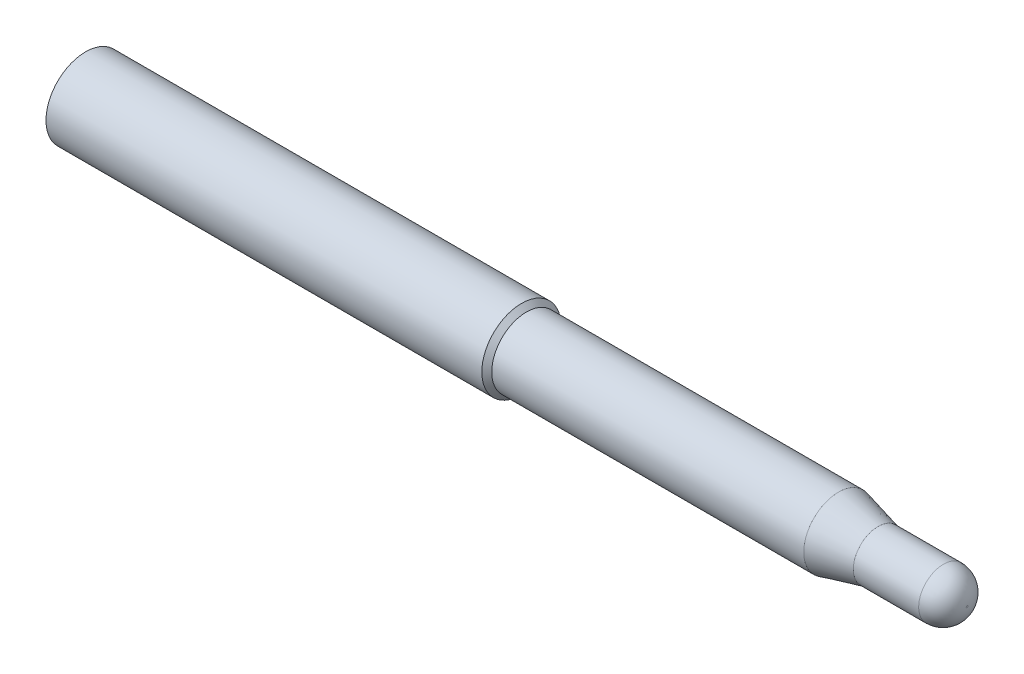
ISO-10303-21;
HEADER;
FILE_DESCRIPTION(('STEP AP214'),'2;1');
FILE_NAME('part.step','',(''),(''),'','','');
FILE_SCHEMA(('AUTOMOTIVE_DESIGN { 1 0 10303 214 1 1 1 1 }'));
ENDSEC;
DATA;
#1=APPLICATION_CONTEXT('core data for automotive mechanical design processes');
#2=APPLICATION_PROTOCOL_DEFINITION('international standard','automotive_design',2000,#1);
#3=PRODUCT_CONTEXT('',#1,'mechanical');
#4=PRODUCT('Part','Part','',(#3));
#5=PRODUCT_RELATED_PRODUCT_CATEGORY('part','',(#4));
#6=PRODUCT_DEFINITION_FORMATION('','',#4);
#7=PRODUCT_DEFINITION_CONTEXT('part definition',#1,'design');
#8=PRODUCT_DEFINITION('design','',#6,#7);
#9=PRODUCT_DEFINITION_SHAPE('','',#8);
#10=(LENGTH_UNIT() NAMED_UNIT(*) SI_UNIT(.MILLI.,.METRE.));
#11=(NAMED_UNIT(*) PLANE_ANGLE_UNIT() SI_UNIT($,.RADIAN.));
#12=(NAMED_UNIT(*) SI_UNIT($,.STERADIAN.) SOLID_ANGLE_UNIT());
#13=UNCERTAINTY_MEASURE_WITH_UNIT(LENGTH_MEASURE(1.E-05),#10,'distance_accuracy_value','');
#14=(GEOMETRIC_REPRESENTATION_CONTEXT(3) GLOBAL_UNCERTAINTY_ASSIGNED_CONTEXT((#13)) GLOBAL_UNIT_ASSIGNED_CONTEXT((#10,
#11,#12)) REPRESENTATION_CONTEXT('',''));
#15=CARTESIAN_POINT('',(0.,0.,0.));
#16=DIRECTION('',(0.,0.,1.));
#17=DIRECTION('',(1.,0.,0.));
#18=AXIS2_PLACEMENT_3D('',#15,#16,#17);
#19=CARTESIAN_POINT('',(0.,0.,0.));
#20=DIRECTION('',(-1.,0.,0.));
#21=DIRECTION('',(0.,-1.,0.));
#22=AXIS2_PLACEMENT_3D('',#19,#20,#21);
#23=PLANE('',#22);
#24=CARTESIAN_POINT('',(0.,0.,0.));
#25=DIRECTION('',(1.,0.,0.));
#26=DIRECTION('',(0.,1.,0.));
#27=AXIS2_PLACEMENT_3D('',#24,#25,#26);
#28=CIRCLE('',#27,2.);
#29=CARTESIAN_POINT('',(0.,2.,0.));
#30=VERTEX_POINT('',#29);
#31=EDGE_CURVE('E41',#30,#30,#28,.T.);
#32=ORIENTED_EDGE('',*,*,#31,.F.);
#33=EDGE_LOOP('',(#32));
#34=FACE_BOUND('',#33,.T.);
#35=ADVANCED_FACE('F30',(#34),#23,.T.);
#36=CARTESIAN_POINT('',(44.5,0.,0.));
#37=DIRECTION('',(1.,0.,0.));
#38=DIRECTION('',(0.,1.,0.));
#39=AXIS2_PLACEMENT_3D('',#36,#37,#38);
#40=CYLINDRICAL_SURFACE('',#39,2.);
#41=ORIENTED_EDGE('',*,*,#31,.T.);
#42=EDGE_LOOP('',(#41));
#43=FACE_BOUND('',#42,.T.);
#44=CARTESIAN_POINT('',(22.,0.,0.));
#45=DIRECTION('',(1.,0.,0.));
#46=DIRECTION('',(0.,1.,0.));
#47=AXIS2_PLACEMENT_3D('',#44,#45,#46);
#48=CIRCLE('',#47,2.);
#49=CARTESIAN_POINT('',(22.,2.,0.));
#50=VERTEX_POINT('',#49);
#51=EDGE_CURVE('E45',#50,#50,#48,.T.);
#52=ORIENTED_EDGE('',*,*,#51,.F.);
#53=EDGE_LOOP('',(#52));
#54=FACE_BOUND('',#53,.T.);
#55=ADVANCED_FACE('F77',(#43,#54),#40,.T.);
#56=CARTESIAN_POINT('',(22.25,0.,0.));
#57=DIRECTION('',(-1.,0.,0.));
#58=DIRECTION('',(0.,-1.,0.));
#59=AXIS2_PLACEMENT_3D('',#56,#57,#58);
#60=CONICAL_SURFACE('',#59,1.75,0.78539816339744);
#61=ORIENTED_EDGE('',*,*,#51,.T.);
#62=EDGE_LOOP('',(#61));
#63=FACE_BOUND('',#62,.T.);
#64=CARTESIAN_POINT('',(22.25,0.,0.));
#65=DIRECTION('',(1.,0.,0.));
#66=DIRECTION('',(0.,1.,0.));
#67=AXIS2_PLACEMENT_3D('',#64,#65,#66);
#68=CIRCLE('',#67,1.75);
#69=CARTESIAN_POINT('',(22.25,1.75,0.));
#70=VERTEX_POINT('',#69);
#71=EDGE_CURVE('E50',#70,#70,#68,.T.);
#72=ORIENTED_EDGE('',*,*,#71,.F.);
#73=EDGE_LOOP('',(#72));
#74=FACE_BOUND('',#73,.T.);
#75=ADVANCED_FACE('F73',(#63,#74),#60,.T.);
#76=CARTESIAN_POINT('',(44.5,0.,0.));
#77=DIRECTION('',(1.,0.,0.));
#78=DIRECTION('',(0.,1.,0.));
#79=AXIS2_PLACEMENT_3D('',#76,#77,#78);
#80=CYLINDRICAL_SURFACE('',#79,1.75);
#81=ORIENTED_EDGE('',*,*,#71,.T.);
#82=EDGE_LOOP('',(#81));
#83=FACE_BOUND('',#82,.T.);
#84=CARTESIAN_POINT('',(38.,0.,0.));
#85=DIRECTION('',(1.,0.,0.));
#86=DIRECTION('',(0.,1.,0.));
#87=AXIS2_PLACEMENT_3D('',#84,#85,#86);
#88=CIRCLE('',#87,1.75);
#89=CARTESIAN_POINT('',(38.,1.75,0.));
#90=VERTEX_POINT('',#89);
#91=EDGE_CURVE('E53',#90,#90,#88,.T.);
#92=ORIENTED_EDGE('',*,*,#91,.F.);
#93=EDGE_LOOP('',(#92));
#94=FACE_BOUND('',#93,.T.);
#95=ADVANCED_FACE('F64',(#83,#94),#80,.T.);
#96=CARTESIAN_POINT('',(40.,0.,0.));
#97=DIRECTION('',(-1.,0.,0.));
#98=DIRECTION('',(0.,-1.,0.));
#99=AXIS2_PLACEMENT_3D('',#96,#97,#98);
#100=CONICAL_SURFACE('',#99,1.25000000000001,0.244978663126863);
#101=ORIENTED_EDGE('',*,*,#91,.T.);
#102=EDGE_LOOP('',(#101));
#103=FACE_BOUND('',#102,.T.);
#104=CARTESIAN_POINT('',(40.,0.,0.));
#105=DIRECTION('',(1.,0.,0.));
#106=DIRECTION('',(0.,1.,0.));
#107=AXIS2_PLACEMENT_3D('',#104,#105,#106);
#108=CIRCLE('',#107,1.25000000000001);
#109=CARTESIAN_POINT('',(40.,1.25,0.));
#110=VERTEX_POINT('',#109);
#111=EDGE_CURVE('E56',#110,#110,#108,.T.);
#112=ORIENTED_EDGE('',*,*,#111,.F.);
#113=EDGE_LOOP('',(#112));
#114=FACE_BOUND('',#113,.T.);
#115=ADVANCED_FACE('F62',(#103,#114),#100,.T.);
#116=CARTESIAN_POINT('',(44.5,0.,0.));
#117=DIRECTION('',(1.,0.,0.));
#118=DIRECTION('',(0.,1.,0.));
#119=AXIS2_PLACEMENT_3D('',#116,#117,#118);
#120=CYLINDRICAL_SURFACE('',#119,1.25000000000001);
#121=CARTESIAN_POINT('',(43.3,0.,0.));
#122=DIRECTION('',(1.,0.,0.));
#123=DIRECTION('',(0.,1.,0.));
#124=AXIS2_PLACEMENT_3D('',#121,#122,#123);
#125=CIRCLE('',#124,1.25000000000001);
#126=CARTESIAN_POINT('',(43.3,1.25,0.));
#127=VERTEX_POINT('',#126);
#128=EDGE_CURVE('E10',#127,#127,#125,.F.);
#129=ORIENTED_EDGE('',*,*,#128,.T.);
#130=EDGE_LOOP('',(#129));
#131=FACE_BOUND('',#130,.T.);
#132=ORIENTED_EDGE('',*,*,#111,.T.);
#133=EDGE_LOOP('',(#132));
#134=FACE_BOUND('',#133,.T.);
#135=ADVANCED_FACE('F60',(#131,#134),#120,.T.);
#136=CARTESIAN_POINT('',(44.5,1.25,0.));
#137=DIRECTION('',(1.,0.,0.));
#138=DIRECTION('',(0.,1.,0.));
#139=AXIS2_PLACEMENT_3D('',#136,#137,#138);
#140=PLANE('',#139);
#141=CARTESIAN_POINT('',(44.5,0.,0.));
#142=DIRECTION('',(1.,0.,0.));
#143=DIRECTION('',(0.,1.,0.));
#144=AXIS2_PLACEMENT_3D('',#141,#142,#143);
#145=CIRCLE('',#144,0.050000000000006);
#146=CARTESIAN_POINT('',(44.5,0.049999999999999,0.));
#147=VERTEX_POINT('',#146);
#148=EDGE_CURVE('E37',#147,#147,#145,.T.);
#149=ORIENTED_EDGE('',*,*,#148,.T.);
#150=EDGE_LOOP('',(#149));
#151=FACE_BOUND('',#150,.T.);
#152=ADVANCED_FACE('F71',(#151),#140,.T.);
#153=CARTESIAN_POINT('',(43.3,0.,0.));
#154=DIRECTION('',(1.,0.,0.));
#155=DIRECTION('',(0.,1.,0.));
#156=AXIS2_PLACEMENT_3D('',#153,#154,#155);
#157=DEGENERATE_TOROIDAL_SURFACE('',#156,0.050000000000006,1.2,.T.);
#158=ORIENTED_EDGE('',*,*,#128,.F.);
#159=EDGE_LOOP('',(#158));
#160=FACE_BOUND('',#159,.T.);
#161=ORIENTED_EDGE('',*,*,#148,.F.);
#162=EDGE_LOOP('',(#161));
#163=FACE_BOUND('',#162,.T.);
#164=ADVANCED_FACE('F32',(#160,#163),#157,.T.);
#165=CLOSED_SHELL('',(#35,#55,#75,#95,#115,#135,#152,#164));
#166=MANIFOLD_SOLID_BREP('B2',#165);
#167=ADVANCED_BREP_SHAPE_REPRESENTATION('',(#18,#166),#14);
#168=SHAPE_DEFINITION_REPRESENTATION(#9,#167);
ENDSEC;
END-ISO-10303-21;
